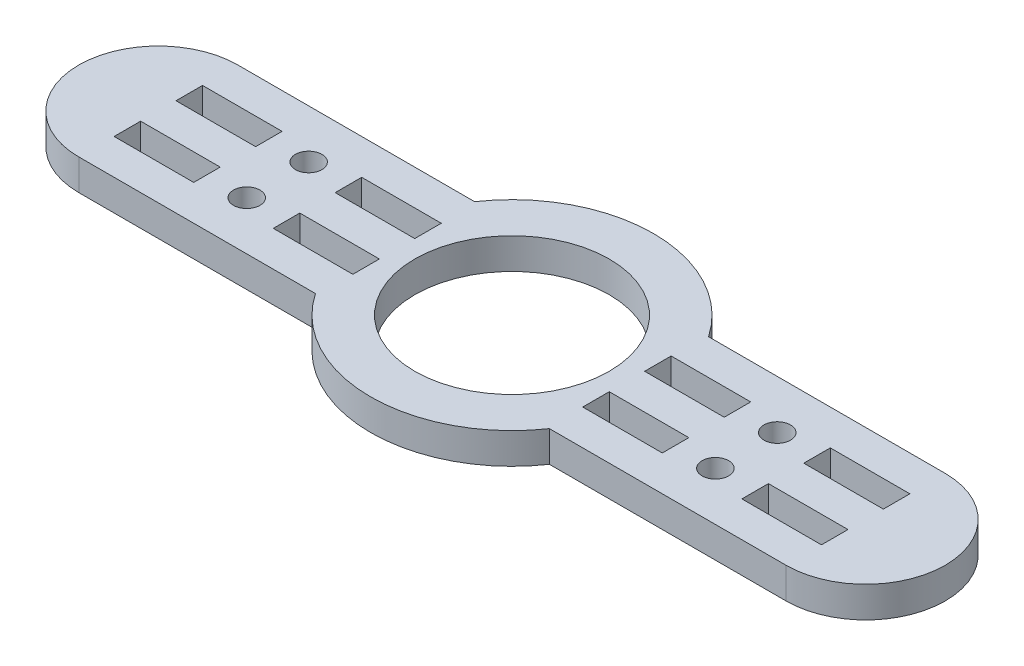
from build123d import *

# Parameters (mm, degrees)
SKETCH1_R           = 11
SKETCH1_W           = 9
SKETCH1_H           = 3
SKETCH1_R_2         = 1.5
BOSS_EXTRUDE1_DEPTH = 3.5


with BuildPart() as part:
    # Sketch1 → Boss-Extrude1 (new body)
    with BuildSketch(Plane(origin=(0, 0, 0), x_dir=(1, 0, 0), z_dir=(0, 1, 0))):
        with BuildLine():
            Line((-13.228756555, 9), (-40, 9))
            ThreePointArc((-40, 9), (-49, 0), (-40, -9))
            Line((-40, -9), (-13.228756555, -9))
            ThreePointArc((-13.228756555, -9), (0, -16), (13.228756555, -9))
            Line((13.228756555, -9), (40, -9))
            ThreePointArc((40, -9), (49, 0), (40, 9))
            Line((40, 9), (13.228756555, 9))
            ThreePointArc((13.228756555, 9), (0, 16), (-13.228756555, 9))
        make_face()
        with Locations(Location((0, 0, 0), (0, 0, 270))):
            Circle(SKETCH1_R, mode=Mode.SUBTRACT)
        with Locations((-35.5, -3.5)):
            Rectangle(SKETCH1_W, SKETCH1_H, mode=Mode.SUBTRACT)
        with Locations(Location((-26.5, -3.5, 0), (0, 0, 270))):
            Circle(SKETCH1_R_2, mode=Mode.SUBTRACT)
        with Locations((-17.5, -3.5)):
            Rectangle(SKETCH1_W, SKETCH1_H, mode=Mode.SUBTRACT)
        with Locations((-35.5, 3.5)):
            Rectangle(SKETCH1_W, SKETCH1_H, mode=Mode.SUBTRACT)
        with Locations(Location((-26.5, 3.5, 0), (0, 0, 270))):
            Circle(SKETCH1_R_2, mode=Mode.SUBTRACT)
        with Locations((-17.5, 3.5)):
            Rectangle(SKETCH1_W, SKETCH1_H, mode=Mode.SUBTRACT)
        with Locations((35.5, 3.5)):
            Rectangle(SKETCH1_W, SKETCH1_H, mode=Mode.SUBTRACT)
        with Locations((17.5, -3.5)):
            Rectangle(SKETCH1_W, SKETCH1_H, mode=Mode.SUBTRACT)
        with Locations(Location((26.5, -3.5, 0), (0, 0, 270))):
            Circle(SKETCH1_R_2, mode=Mode.SUBTRACT)
        with Locations((35.5, -3.5)):
            Rectangle(SKETCH1_W, SKETCH1_H, mode=Mode.SUBTRACT)
        with Locations((17.5, 3.5)):
            Rectangle(SKETCH1_W, SKETCH1_H, mode=Mode.SUBTRACT)
        with Locations(Location((26.5, 3.5, 0), (0, 0, 270))):
            Circle(SKETCH1_R_2, mode=Mode.SUBTRACT)
    extrude(amount=BOSS_EXTRUDE1_DEPTH)


solid = part.part
